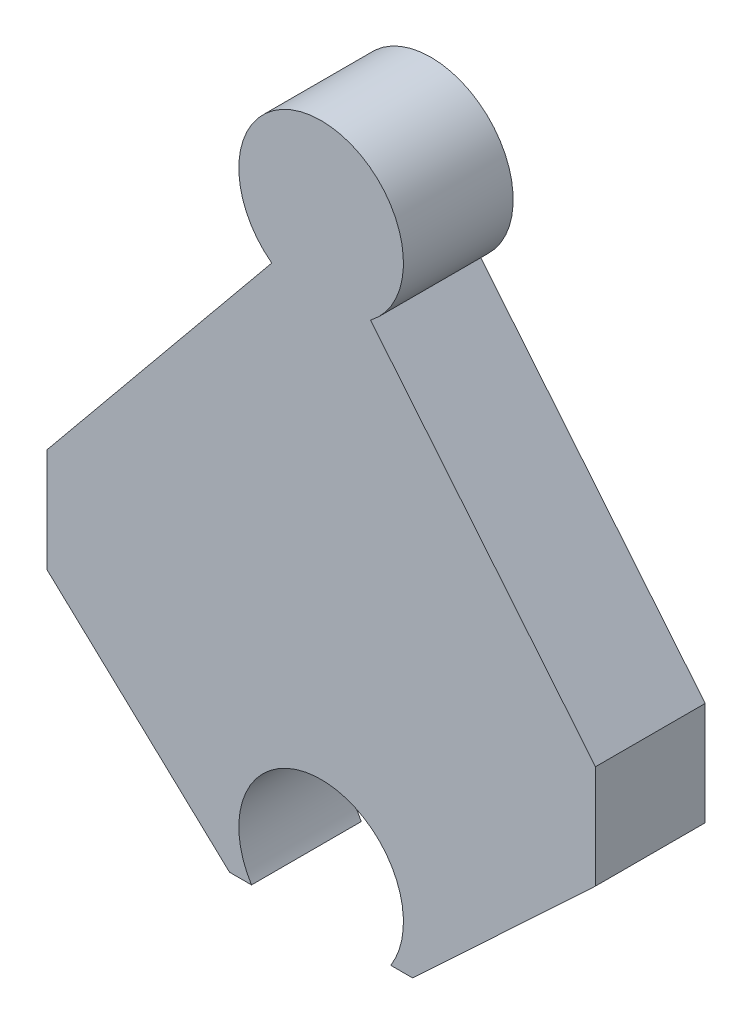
ISO-10303-21;
HEADER;
FILE_DESCRIPTION(('STEP AP214'),'2;1');
FILE_NAME('part.step','',(''),(''),'','','');
FILE_SCHEMA(('AUTOMOTIVE_DESIGN { 1 0 10303 214 1 1 1 1 }'));
ENDSEC;
DATA;
#1=APPLICATION_CONTEXT('core data for automotive mechanical design processes');
#2=APPLICATION_PROTOCOL_DEFINITION('international standard','automotive_design',2000,#1);
#3=PRODUCT_CONTEXT('',#1,'mechanical');
#4=PRODUCT('Part','Part','',(#3));
#5=PRODUCT_RELATED_PRODUCT_CATEGORY('part','',(#4));
#6=PRODUCT_DEFINITION_FORMATION('','',#4);
#7=PRODUCT_DEFINITION_CONTEXT('part definition',#1,'design');
#8=PRODUCT_DEFINITION('design','',#6,#7);
#9=PRODUCT_DEFINITION_SHAPE('','',#8);
#10=(LENGTH_UNIT() NAMED_UNIT(*) SI_UNIT(.MILLI.,.METRE.));
#11=(NAMED_UNIT(*) PLANE_ANGLE_UNIT() SI_UNIT($,.RADIAN.));
#12=(NAMED_UNIT(*) SI_UNIT($,.STERADIAN.) SOLID_ANGLE_UNIT());
#13=UNCERTAINTY_MEASURE_WITH_UNIT(LENGTH_MEASURE(1.E-05),#10,'distance_accuracy_value','');
#14=(GEOMETRIC_REPRESENTATION_CONTEXT(3) GLOBAL_UNCERTAINTY_ASSIGNED_CONTEXT((#13)) GLOBAL_UNIT_ASSIGNED_CONTEXT((#10,
#11,#12)) REPRESENTATION_CONTEXT('',''));
#15=CARTESIAN_POINT('',(0.,0.,0.));
#16=DIRECTION('',(0.,0.,1.));
#17=DIRECTION('',(1.,0.,0.));
#18=AXIS2_PLACEMENT_3D('',#15,#16,#17);
#19=CARTESIAN_POINT('',(0.,31.,-10.));
#20=DIRECTION('',(0.,0.,1.));
#21=DIRECTION('',(1.,0.,0.));
#22=AXIS2_PLACEMENT_3D('',#19,#20,#21);
#23=CYLINDRICAL_SURFACE('',#22,7.5);
#24=CARTESIAN_POINT('',(0.,31.,0.));
#25=DIRECTION('',(0.,0.,1.));
#26=DIRECTION('',(1.,0.,0.));
#27=AXIS2_PLACEMENT_3D('',#24,#25,#26);
#28=CIRCLE('',#27,7.5);
#29=CARTESIAN_POINT('',(4.50000000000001,25.,0.));
#30=VERTEX_POINT('',#29);
#31=CARTESIAN_POINT('',(-4.50000000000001,25.,0.));
#32=VERTEX_POINT('',#31);
#33=EDGE_CURVE('E144',#30,#32,#28,.T.);
#34=ORIENTED_EDGE('',*,*,#33,.F.);
#35=DIRECTION('',(0.,0.,1.));
#36=VECTOR('',#35,1.);
#37=CARTESIAN_POINT('',(4.50000000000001,25.,-10.));
#38=LINE('',#37,#36);
#39=CARTESIAN_POINT('',(4.50000000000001,25.,-10.));
#40=VERTEX_POINT('',#39);
#41=EDGE_CURVE('E11',#40,#30,#38,.T.);
#42=ORIENTED_EDGE('',*,*,#41,.F.);
#43=CARTESIAN_POINT('',(0.,31.,-10.));
#44=DIRECTION('',(0.,0.,1.));
#45=DIRECTION('',(1.,0.,0.));
#46=AXIS2_PLACEMENT_3D('',#43,#44,#45);
#47=CIRCLE('',#46,7.5);
#48=CARTESIAN_POINT('',(-4.50000000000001,25.,-10.));
#49=VERTEX_POINT('',#48);
#50=EDGE_CURVE('E164',#40,#49,#47,.T.);
#51=ORIENTED_EDGE('',*,*,#50,.T.);
#52=DIRECTION('',(0.,0.,1.));
#53=VECTOR('',#52,1.);
#54=CARTESIAN_POINT('',(-4.50000000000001,25.,-10.));
#55=LINE('',#54,#53);
#56=EDGE_CURVE('E36',#49,#32,#55,.T.);
#57=ORIENTED_EDGE('',*,*,#56,.T.);
#58=EDGE_LOOP('',(#34,#42,#51,#57));
#59=FACE_BOUND('',#58,.T.);
#60=ADVANCED_FACE('F33',(#59),#23,.T.);
#61=CARTESIAN_POINT('',(42.8366823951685,-21.752051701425,-10.));
#62=DIRECTION('',(-0.773267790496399,-0.634079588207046,0.));
#63=DIRECTION('',(0.634079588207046,-0.773267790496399,0.));
#64=AXIS2_PLACEMENT_3D('',#61,#62,#63);
#65=PLANE('',#64);
#66=DIRECTION('',(0.634079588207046,-0.773267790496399,0.));
#67=VECTOR('',#66,1.);
#68=CARTESIAN_POINT('',(42.8366823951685,-21.752051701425,0.));
#69=LINE('',#68,#67);
#70=CARTESIAN_POINT('',(25.,0.,0.));
#71=VERTEX_POINT('',#70);
#72=EDGE_CURVE('E84',#30,#71,#69,.T.);
#73=ORIENTED_EDGE('',*,*,#72,.T.);
#74=DIRECTION('',(0.,0.,1.));
#75=VECTOR('',#74,1.);
#76=CARTESIAN_POINT('',(25.,0.,-10.));
#77=LINE('',#76,#75);
#78=CARTESIAN_POINT('',(25.,0.,-10.));
#79=VERTEX_POINT('',#78);
#80=EDGE_CURVE('E42',#79,#71,#77,.T.);
#81=ORIENTED_EDGE('',*,*,#80,.F.);
#82=DIRECTION('',(0.634079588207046,-0.773267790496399,0.));
#83=VECTOR('',#82,1.);
#84=CARTESIAN_POINT('',(42.8366823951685,-21.752051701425,-10.));
#85=LINE('',#84,#83);
#86=EDGE_CURVE('E121',#40,#79,#85,.T.);
#87=ORIENTED_EDGE('',*,*,#86,.F.);
#88=ORIENTED_EDGE('',*,*,#41,.T.);
#89=EDGE_LOOP('',(#73,#81,#87,#88));
#90=FACE_BOUND('',#89,.T.);
#91=ADVANCED_FACE('F224',(#90),#65,.F.);
#92=CARTESIAN_POINT('',(25.,-56.8781312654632,-10.));
#93=DIRECTION('',(-1.,0.,0.));
#94=DIRECTION('',(0.,0.,1.));
#95=AXIS2_PLACEMENT_3D('',#92,#93,#94);
#96=PLANE('',#95);
#97=DIRECTION('',(0.,-1.,0.));
#98=VECTOR('',#97,1.);
#99=CARTESIAN_POINT('',(25.,-56.8781312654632,0.));
#100=LINE('',#99,#98);
#101=CARTESIAN_POINT('',(25.,-9.42198927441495,0.));
#102=VERTEX_POINT('',#101);
#103=EDGE_CURVE('E128',#71,#102,#100,.T.);
#104=ORIENTED_EDGE('',*,*,#103,.T.);
#105=DIRECTION('',(0.,0.,1.));
#106=VECTOR('',#105,1.);
#107=CARTESIAN_POINT('',(25.,-9.42198927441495,-10.));
#108=LINE('',#107,#106);
#109=CARTESIAN_POINT('',(25.,-9.42198927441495,-10.));
#110=VERTEX_POINT('',#109);
#111=EDGE_CURVE('E125',#110,#102,#108,.T.);
#112=ORIENTED_EDGE('',*,*,#111,.F.);
#113=DIRECTION('',(0.,-1.,0.));
#114=VECTOR('',#113,1.);
#115=CARTESIAN_POINT('',(25.,-56.8781312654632,-10.));
#116=LINE('',#115,#114);
#117=EDGE_CURVE('E115',#79,#110,#116,.T.);
#118=ORIENTED_EDGE('',*,*,#117,.F.);
#119=ORIENTED_EDGE('',*,*,#80,.T.);
#120=EDGE_LOOP('',(#104,#112,#118,#119));
#121=FACE_BOUND('',#120,.T.);
#122=ADVANCED_FACE('F126',(#121),#96,.F.);
#123=CARTESIAN_POINT('',(-12.0102177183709,-44.0367760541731,-10.));
#124=DIRECTION('',(0.683076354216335,-0.730346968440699,0.));
#125=DIRECTION('',(0.730346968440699,0.683076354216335,0.));
#126=AXIS2_PLACEMENT_3D('',#123,#124,#125);
#127=PLANE('',#126);
#128=DIRECTION('',(0.730346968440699,0.683076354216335,0.));
#129=VECTOR('',#128,1.);
#130=CARTESIAN_POINT('',(-12.0102177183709,-44.0367760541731,0.));
#131=LINE('',#130,#129);
#132=CARTESIAN_POINT('',(8.34395146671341,-25.,0.));
#133=VERTEX_POINT('',#132);
#134=EDGE_CURVE('E161',#133,#102,#131,.T.);
#135=ORIENTED_EDGE('',*,*,#134,.F.);
#136=DIRECTION('',(0.,0.,1.));
#137=VECTOR('',#136,1.);
#138=CARTESIAN_POINT('',(8.34395146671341,-25.,-10.));
#139=LINE('',#138,#137);
#140=CARTESIAN_POINT('',(8.34395146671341,-25.,-10.));
#141=VERTEX_POINT('',#140);
#142=EDGE_CURVE('E132',#141,#133,#139,.T.);
#143=ORIENTED_EDGE('',*,*,#142,.F.);
#144=DIRECTION('',(0.730346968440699,0.683076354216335,0.));
#145=VECTOR('',#144,1.);
#146=CARTESIAN_POINT('',(-12.0102177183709,-44.0367760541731,-10.));
#147=LINE('',#146,#145);
#148=EDGE_CURVE('E120',#141,#110,#147,.T.);
#149=ORIENTED_EDGE('',*,*,#148,.T.);
#150=ORIENTED_EDGE('',*,*,#111,.T.);
#151=EDGE_LOOP('',(#135,#143,#149,#150));
#152=FACE_BOUND('',#151,.T.);
#153=ADVANCED_FACE('F134',(#152),#127,.T.);
#154=CARTESIAN_POINT('',(0.,-25.,-10.));
#155=DIRECTION('',(0.,1.,0.));
#156=DIRECTION('',(0.,0.,1.));
#157=AXIS2_PLACEMENT_3D('',#154,#155,#156);
#158=PLANE('',#157);
#159=DIRECTION('',(-1.,0.,0.));
#160=VECTOR('',#159,1.);
#161=CARTESIAN_POINT('',(0.,-25.,0.));
#162=LINE('',#161,#160);
#163=CARTESIAN_POINT('',(6.34428877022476,-25.,0.));
#164=VERTEX_POINT('',#163);
#165=EDGE_CURVE('E159',#133,#164,#162,.T.);
#166=ORIENTED_EDGE('',*,*,#165,.T.);
#167=DIRECTION('',(0.,0.,1.));
#168=VECTOR('',#167,1.);
#169=CARTESIAN_POINT('',(6.34428877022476,-25.,-10.));
#170=LINE('',#169,#168);
#171=CARTESIAN_POINT('',(6.34428877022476,-25.,-10.));
#172=VERTEX_POINT('',#171);
#173=EDGE_CURVE('E168',#172,#164,#170,.T.);
#174=ORIENTED_EDGE('',*,*,#173,.F.);
#175=DIRECTION('',(-1.,0.,0.));
#176=VECTOR('',#175,1.);
#177=CARTESIAN_POINT('',(0.,-25.,-10.));
#178=LINE('',#177,#176);
#179=EDGE_CURVE('E136',#141,#172,#178,.T.);
#180=ORIENTED_EDGE('',*,*,#179,.F.);
#181=ORIENTED_EDGE('',*,*,#142,.T.);
#182=EDGE_LOOP('',(#166,#174,#180,#181));
#183=FACE_BOUND('',#182,.T.);
#184=ADVANCED_FACE('F188',(#183),#158,.F.);
#185=CARTESIAN_POINT('',(0.,-21.,-10.));
#186=DIRECTION('',(0.,0.,1.));
#187=DIRECTION('',(1.,0.,0.));
#188=AXIS2_PLACEMENT_3D('',#185,#186,#187);
#189=CYLINDRICAL_SURFACE('',#188,7.5);
#190=CARTESIAN_POINT('',(0.,-21.,0.));
#191=DIRECTION('',(0.,0.,1.));
#192=DIRECTION('',(1.,0.,0.));
#193=AXIS2_PLACEMENT_3D('',#190,#191,#192);
#194=CIRCLE('',#193,7.5);
#195=CARTESIAN_POINT('',(-6.34428877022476,-25.,0.));
#196=VERTEX_POINT('',#195);
#197=EDGE_CURVE('E158',#164,#196,#194,.T.);
#198=ORIENTED_EDGE('',*,*,#197,.T.);
#199=DIRECTION('',(0.,0.,1.));
#200=VECTOR('',#199,1.);
#201=CARTESIAN_POINT('',(-6.34428877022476,-25.,-10.));
#202=LINE('',#201,#200);
#203=CARTESIAN_POINT('',(-6.34428877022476,-25.,-10.));
#204=VERTEX_POINT('',#203);
#205=EDGE_CURVE('E171',#204,#196,#202,.T.);
#206=ORIENTED_EDGE('',*,*,#205,.F.);
#207=CARTESIAN_POINT('',(0.,-21.,-10.));
#208=DIRECTION('',(0.,0.,1.));
#209=DIRECTION('',(1.,0.,0.));
#210=AXIS2_PLACEMENT_3D('',#207,#208,#209);
#211=CIRCLE('',#210,7.5);
#212=EDGE_CURVE('E138',#172,#204,#211,.T.);
#213=ORIENTED_EDGE('',*,*,#212,.F.);
#214=ORIENTED_EDGE('',*,*,#173,.T.);
#215=EDGE_LOOP('',(#198,#206,#213,#214));
#216=FACE_BOUND('',#215,.T.);
#217=ADVANCED_FACE('F191',(#216),#189,.F.);
#218=CARTESIAN_POINT('',(-8.34395146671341,-25.,0.));
#219=VERTEX_POINT('',#218);
#220=EDGE_CURVE('E156',#196,#219,#162,.T.);
#221=ORIENTED_EDGE('',*,*,#220,.T.);
#222=DIRECTION('',(0.,0.,1.));
#223=VECTOR('',#222,1.);
#224=CARTESIAN_POINT('',(-8.34395146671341,-25.,-10.));
#225=LINE('',#224,#223);
#226=CARTESIAN_POINT('',(-8.34395146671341,-25.,-10.));
#227=VERTEX_POINT('',#226);
#228=EDGE_CURVE('E174',#227,#219,#225,.T.);
#229=ORIENTED_EDGE('',*,*,#228,.F.);
#230=EDGE_CURVE('E140',#204,#227,#178,.T.);
#231=ORIENTED_EDGE('',*,*,#230,.F.);
#232=ORIENTED_EDGE('',*,*,#205,.T.);
#233=EDGE_LOOP('',(#221,#229,#231,#232));
#234=FACE_BOUND('',#233,.T.);
#235=ADVANCED_FACE('F212',(#234),#158,.F.);
#236=CARTESIAN_POINT('',(12.0102177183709,-44.0367760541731,-10.));
#237=DIRECTION('',(0.683076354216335,0.730346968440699,0.));
#238=DIRECTION('',(-0.730346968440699,0.683076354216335,0.));
#239=AXIS2_PLACEMENT_3D('',#236,#237,#238);
#240=PLANE('',#239);
#241=DIRECTION('',(-0.730346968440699,0.683076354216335,0.));
#242=VECTOR('',#241,1.);
#243=CARTESIAN_POINT('',(12.0102177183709,-44.0367760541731,0.));
#244=LINE('',#243,#242);
#245=CARTESIAN_POINT('',(-25.,-9.42198927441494,0.));
#246=VERTEX_POINT('',#245);
#247=EDGE_CURVE('E153',#219,#246,#244,.T.);
#248=ORIENTED_EDGE('',*,*,#247,.T.);
#249=DIRECTION('',(0.,0.,1.));
#250=VECTOR('',#249,1.);
#251=CARTESIAN_POINT('',(-25.,-9.42198927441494,-10.));
#252=LINE('',#251,#250);
#253=CARTESIAN_POINT('',(-25.,-9.42198927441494,-10.));
#254=VERTEX_POINT('',#253);
#255=EDGE_CURVE('E177',#254,#246,#252,.T.);
#256=ORIENTED_EDGE('',*,*,#255,.F.);
#257=DIRECTION('',(-0.730346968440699,0.683076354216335,0.));
#258=VECTOR('',#257,1.);
#259=CARTESIAN_POINT('',(12.0102177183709,-44.0367760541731,-10.));
#260=LINE('',#259,#258);
#261=EDGE_CURVE('E194',#227,#254,#260,.T.);
#262=ORIENTED_EDGE('',*,*,#261,.F.);
#263=ORIENTED_EDGE('',*,*,#228,.T.);
#264=EDGE_LOOP('',(#248,#256,#262,#263));
#265=FACE_BOUND('',#264,.T.);
#266=ADVANCED_FACE('F210',(#265),#240,.F.);
#267=CARTESIAN_POINT('',(-25.,-56.8781312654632,-10.));
#268=DIRECTION('',(-1.,0.,0.));
#269=DIRECTION('',(0.,0.,1.));
#270=AXIS2_PLACEMENT_3D('',#267,#268,#269);
#271=PLANE('',#270);
#272=DIRECTION('',(0.,-1.,0.));
#273=VECTOR('',#272,1.);
#274=CARTESIAN_POINT('',(-25.,-56.8781312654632,0.));
#275=LINE('',#274,#273);
#276=CARTESIAN_POINT('',(-25.,0.,0.));
#277=VERTEX_POINT('',#276);
#278=EDGE_CURVE('E150',#277,#246,#275,.T.);
#279=ORIENTED_EDGE('',*,*,#278,.F.);
#280=DIRECTION('',(0.,0.,1.));
#281=VECTOR('',#280,1.);
#282=CARTESIAN_POINT('',(-25.,0.,-10.));
#283=LINE('',#282,#281);
#284=CARTESIAN_POINT('',(-25.,0.,-10.));
#285=VERTEX_POINT('',#284);
#286=EDGE_CURVE('E178',#285,#277,#283,.T.);
#287=ORIENTED_EDGE('',*,*,#286,.F.);
#288=DIRECTION('',(0.,-1.,0.));
#289=VECTOR('',#288,1.);
#290=CARTESIAN_POINT('',(-25.,-56.8781312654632,-10.));
#291=LINE('',#290,#289);
#292=EDGE_CURVE('E196',#285,#254,#291,.T.);
#293=ORIENTED_EDGE('',*,*,#292,.T.);
#294=ORIENTED_EDGE('',*,*,#255,.T.);
#295=EDGE_LOOP('',(#279,#287,#293,#294));
#296=FACE_BOUND('',#295,.T.);
#297=ADVANCED_FACE('F207',(#296),#271,.T.);
#298=CARTESIAN_POINT('',(-42.8366823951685,-21.752051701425,-10.));
#299=DIRECTION('',(-0.773267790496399,0.634079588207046,0.));
#300=DIRECTION('',(-0.634079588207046,-0.773267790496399,0.));
#301=AXIS2_PLACEMENT_3D('',#298,#299,#300);
#302=PLANE('',#301);
#303=DIRECTION('',(-0.634079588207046,-0.773267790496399,0.));
#304=VECTOR('',#303,1.);
#305=CARTESIAN_POINT('',(-42.8366823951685,-21.752051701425,0.));
#306=LINE('',#305,#304);
#307=EDGE_CURVE('E147',#32,#277,#306,.T.);
#308=ORIENTED_EDGE('',*,*,#307,.F.);
#309=ORIENTED_EDGE('',*,*,#56,.F.);
#310=DIRECTION('',(-0.634079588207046,-0.773267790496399,0.));
#311=VECTOR('',#310,1.);
#312=CARTESIAN_POINT('',(-42.8366823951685,-21.752051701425,-10.));
#313=LINE('',#312,#311);
#314=EDGE_CURVE('E201',#49,#285,#313,.T.);
#315=ORIENTED_EDGE('',*,*,#314,.T.);
#316=ORIENTED_EDGE('',*,*,#286,.T.);
#317=EDGE_LOOP('',(#308,#309,#315,#316));
#318=FACE_BOUND('',#317,.T.);
#319=ADVANCED_FACE('F180',(#318),#302,.T.);
#320=CARTESIAN_POINT('',(0.,-56.8781312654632,-10.));
#321=DIRECTION('',(0.,0.,1.));
#322=DIRECTION('',(1.,0.,0.));
#323=AXIS2_PLACEMENT_3D('',#320,#321,#322);
#324=PLANE('',#323);
#325=ORIENTED_EDGE('',*,*,#50,.F.);
#326=ORIENTED_EDGE('',*,*,#86,.T.);
#327=ORIENTED_EDGE('',*,*,#117,.T.);
#328=ORIENTED_EDGE('',*,*,#148,.F.);
#329=ORIENTED_EDGE('',*,*,#179,.T.);
#330=ORIENTED_EDGE('',*,*,#212,.T.);
#331=ORIENTED_EDGE('',*,*,#230,.T.);
#332=ORIENTED_EDGE('',*,*,#261,.T.);
#333=ORIENTED_EDGE('',*,*,#292,.F.);
#334=ORIENTED_EDGE('',*,*,#314,.F.);
#335=EDGE_LOOP('',(#325,#326,#327,#328,#329,#330,#331,#332,#333,#334));
#336=FACE_BOUND('',#335,.T.);
#337=ADVANCED_FACE('F118',(#336),#324,.F.);
#338=CARTESIAN_POINT('',(0.,-56.8781312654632,0.));
#339=DIRECTION('',(0.,0.,1.));
#340=DIRECTION('',(1.,0.,0.));
#341=AXIS2_PLACEMENT_3D('',#338,#339,#340);
#342=PLANE('',#341);
#343=ORIENTED_EDGE('',*,*,#33,.T.);
#344=ORIENTED_EDGE('',*,*,#307,.T.);
#345=ORIENTED_EDGE('',*,*,#278,.T.);
#346=ORIENTED_EDGE('',*,*,#247,.F.);
#347=ORIENTED_EDGE('',*,*,#220,.F.);
#348=ORIENTED_EDGE('',*,*,#197,.F.);
#349=ORIENTED_EDGE('',*,*,#165,.F.);
#350=ORIENTED_EDGE('',*,*,#134,.T.);
#351=ORIENTED_EDGE('',*,*,#103,.F.);
#352=ORIENTED_EDGE('',*,*,#72,.F.);
#353=EDGE_LOOP('',(#343,#344,#345,#346,#347,#348,#349,#350,#351,#352));
#354=FACE_BOUND('',#353,.T.);
#355=ADVANCED_FACE('F182',(#354),#342,.T.);
#356=CLOSED_SHELL('',(#60,#91,#122,#153,#184,#217,#235,#266,#297,#319,#337,#355));
#357=MANIFOLD_SOLID_BREP('B2',#356);
#358=ADVANCED_BREP_SHAPE_REPRESENTATION('',(#18,#357),#14);
#359=SHAPE_DEFINITION_REPRESENTATION(#9,#358);
ENDSEC;
END-ISO-10303-21;
